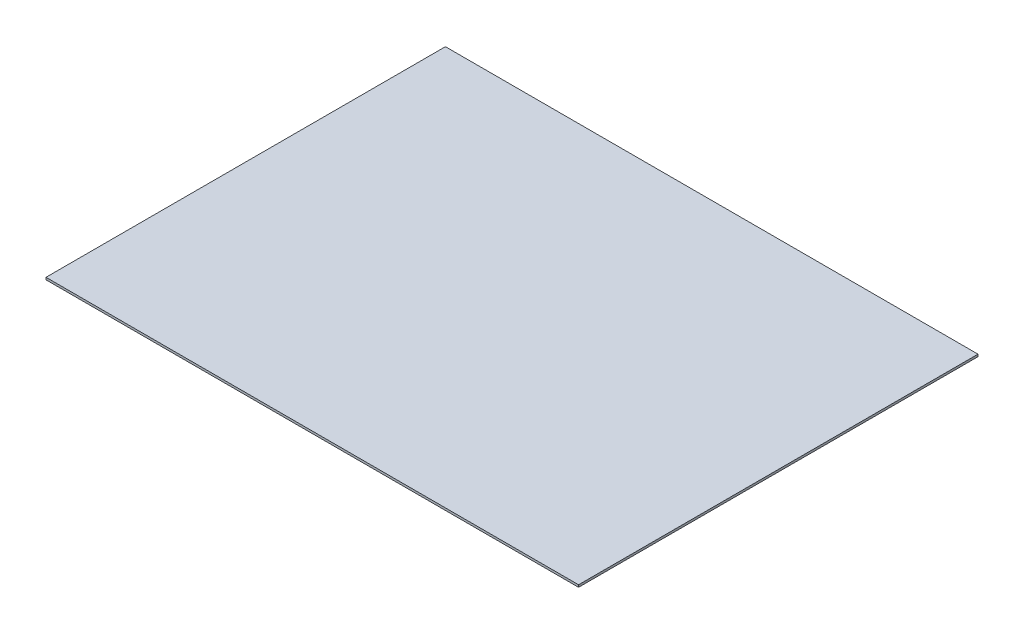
ISO-10303-21;
HEADER;
FILE_DESCRIPTION(('STEP AP214'),'2;1');
FILE_NAME('part.step','',(''),(''),'','','');
FILE_SCHEMA(('AUTOMOTIVE_DESIGN { 1 0 10303 214 1 1 1 1 }'));
ENDSEC;
DATA;
#1=APPLICATION_CONTEXT('core data for automotive mechanical design processes');
#2=APPLICATION_PROTOCOL_DEFINITION('international standard','automotive_design',2000,#1);
#3=PRODUCT_CONTEXT('',#1,'mechanical');
#4=PRODUCT('Part','Part','',(#3));
#5=PRODUCT_RELATED_PRODUCT_CATEGORY('part','',(#4));
#6=PRODUCT_DEFINITION_FORMATION('','',#4);
#7=PRODUCT_DEFINITION_CONTEXT('part definition',#1,'design');
#8=PRODUCT_DEFINITION('design','',#6,#7);
#9=PRODUCT_DEFINITION_SHAPE('','',#8);
#10=(LENGTH_UNIT() NAMED_UNIT(*) SI_UNIT(.MILLI.,.METRE.));
#11=(NAMED_UNIT(*) PLANE_ANGLE_UNIT() SI_UNIT($,.RADIAN.));
#12=(NAMED_UNIT(*) SI_UNIT($,.STERADIAN.) SOLID_ANGLE_UNIT());
#13=UNCERTAINTY_MEASURE_WITH_UNIT(LENGTH_MEASURE(1.E-05),#10,'distance_accuracy_value','');
#14=(GEOMETRIC_REPRESENTATION_CONTEXT(3) GLOBAL_UNCERTAINTY_ASSIGNED_CONTEXT((#13)) GLOBAL_UNIT_ASSIGNED_CONTEXT((#10,
#11,#12)) REPRESENTATION_CONTEXT('',''));
#15=CARTESIAN_POINT('',(0.,0.,0.));
#16=DIRECTION('',(0.,0.,1.));
#17=DIRECTION('',(1.,0.,0.));
#18=AXIS2_PLACEMENT_3D('',#15,#16,#17);
#19=CARTESIAN_POINT('',(1200.,10.,-900.));
#20=DIRECTION('',(-1.,0.,0.));
#21=DIRECTION('',(0.,0.,1.));
#22=AXIS2_PLACEMENT_3D('',#19,#20,#21);
#23=PLANE('',#22);
#24=DIRECTION('',(0.,0.,-1.));
#25=VECTOR('',#24,1.);
#26=CARTESIAN_POINT('',(1200.,0.,-900.));
#27=LINE('',#26,#25);
#28=CARTESIAN_POINT('',(1200.,0.,900.));
#29=VERTEX_POINT('',#28);
#30=CARTESIAN_POINT('',(1200.,0.,-900.));
#31=VERTEX_POINT('',#30);
#32=EDGE_CURVE('E102',#29,#31,#27,.T.);
#33=ORIENTED_EDGE('',*,*,#32,.T.);
#34=DIRECTION('',(0.,-1.,0.));
#35=VECTOR('',#34,1.);
#36=CARTESIAN_POINT('',(1200.,10.,-900.));
#37=LINE('',#36,#35);
#38=CARTESIAN_POINT('',(1200.,10.,-900.));
#39=VERTEX_POINT('',#38);
#40=EDGE_CURVE('E11',#39,#31,#37,.T.);
#41=ORIENTED_EDGE('',*,*,#40,.F.);
#42=DIRECTION('',(0.,0.,-1.));
#43=VECTOR('',#42,1.);
#44=CARTESIAN_POINT('',(1200.,10.,-900.));
#45=LINE('',#44,#43);
#46=CARTESIAN_POINT('',(1200.,10.,900.));
#47=VERTEX_POINT('',#46);
#48=EDGE_CURVE('E90',#47,#39,#45,.T.);
#49=ORIENTED_EDGE('',*,*,#48,.F.);
#50=DIRECTION('',(0.,-1.,0.));
#51=VECTOR('',#50,1.);
#52=CARTESIAN_POINT('',(1200.,10.,900.));
#53=LINE('',#52,#51);
#54=EDGE_CURVE('E98',#47,#29,#53,.T.);
#55=ORIENTED_EDGE('',*,*,#54,.T.);
#56=EDGE_LOOP('',(#33,#41,#49,#55));
#57=FACE_BOUND('',#56,.T.);
#58=ADVANCED_FACE('F39',(#57),#23,.F.);
#59=CARTESIAN_POINT('',(-1200.,10.,-900.));
#60=DIRECTION('',(0.,0.,1.));
#61=DIRECTION('',(1.,0.,0.));
#62=AXIS2_PLACEMENT_3D('',#59,#60,#61);
#63=PLANE('',#62);
#64=DIRECTION('',(-1.,0.,0.));
#65=VECTOR('',#64,1.);
#66=CARTESIAN_POINT('',(-1200.,0.,-900.));
#67=LINE('',#66,#65);
#68=CARTESIAN_POINT('',(-1200.,0.,-900.));
#69=VERTEX_POINT('',#68);
#70=EDGE_CURVE('E94',#31,#69,#67,.T.);
#71=ORIENTED_EDGE('',*,*,#70,.T.);
#72=DIRECTION('',(0.,-1.,0.));
#73=VECTOR('',#72,1.);
#74=CARTESIAN_POINT('',(-1200.,10.,-900.));
#75=LINE('',#74,#73);
#76=CARTESIAN_POINT('',(-1200.,10.,-900.));
#77=VERTEX_POINT('',#76);
#78=EDGE_CURVE('E47',#77,#69,#75,.T.);
#79=ORIENTED_EDGE('',*,*,#78,.F.);
#80=DIRECTION('',(-1.,0.,0.));
#81=VECTOR('',#80,1.);
#82=CARTESIAN_POINT('',(-1200.,10.,-900.));
#83=LINE('',#82,#81);
#84=EDGE_CURVE('E85',#39,#77,#83,.T.);
#85=ORIENTED_EDGE('',*,*,#84,.F.);
#86=ORIENTED_EDGE('',*,*,#40,.T.);
#87=EDGE_LOOP('',(#71,#79,#85,#86));
#88=FACE_BOUND('',#87,.T.);
#89=ADVANCED_FACE('F93',(#88),#63,.F.);
#90=CARTESIAN_POINT('',(-1200.,10.,-900.));
#91=DIRECTION('',(1.,0.,0.));
#92=DIRECTION('',(0.,0.,-1.));
#93=AXIS2_PLACEMENT_3D('',#90,#91,#92);
#94=PLANE('',#93);
#95=DIRECTION('',(0.,0.,1.));
#96=VECTOR('',#95,1.);
#97=CARTESIAN_POINT('',(-1200.,0.,-900.));
#98=LINE('',#97,#96);
#99=CARTESIAN_POINT('',(-1200.,0.,900.));
#100=VERTEX_POINT('',#99);
#101=EDGE_CURVE('E72',#69,#100,#98,.T.);
#102=ORIENTED_EDGE('',*,*,#101,.T.);
#103=DIRECTION('',(0.,-1.,0.));
#104=VECTOR('',#103,1.);
#105=CARTESIAN_POINT('',(-1200.,10.,900.));
#106=LINE('',#105,#104);
#107=CARTESIAN_POINT('',(-1200.,10.,900.));
#108=VERTEX_POINT('',#107);
#109=EDGE_CURVE('E95',#108,#100,#106,.T.);
#110=ORIENTED_EDGE('',*,*,#109,.F.);
#111=DIRECTION('',(0.,0.,1.));
#112=VECTOR('',#111,1.);
#113=CARTESIAN_POINT('',(-1200.,10.,-900.));
#114=LINE('',#113,#112);
#115=EDGE_CURVE('E88',#77,#108,#114,.T.);
#116=ORIENTED_EDGE('',*,*,#115,.F.);
#117=ORIENTED_EDGE('',*,*,#78,.T.);
#118=EDGE_LOOP('',(#102,#110,#116,#117));
#119=FACE_BOUND('',#118,.T.);
#120=ADVANCED_FACE('F96',(#119),#94,.F.);
#121=CARTESIAN_POINT('',(-1200.,10.,900.));
#122=DIRECTION('',(0.,0.,-1.));
#123=DIRECTION('',(-1.,0.,0.));
#124=AXIS2_PLACEMENT_3D('',#121,#122,#123);
#125=PLANE('',#124);
#126=DIRECTION('',(1.,0.,0.));
#127=VECTOR('',#126,1.);
#128=CARTESIAN_POINT('',(-1200.,0.,900.));
#129=LINE('',#128,#127);
#130=EDGE_CURVE('E78',#100,#29,#129,.T.);
#131=ORIENTED_EDGE('',*,*,#130,.T.);
#132=ORIENTED_EDGE('',*,*,#54,.F.);
#133=DIRECTION('',(1.,0.,0.));
#134=VECTOR('',#133,1.);
#135=CARTESIAN_POINT('',(-1200.,10.,900.));
#136=LINE('',#135,#134);
#137=EDGE_CURVE('E55',#108,#47,#136,.T.);
#138=ORIENTED_EDGE('',*,*,#137,.F.);
#139=ORIENTED_EDGE('',*,*,#109,.T.);
#140=EDGE_LOOP('',(#131,#132,#138,#139));
#141=FACE_BOUND('',#140,.T.);
#142=ADVANCED_FACE('F109',(#141),#125,.F.);
#143=CARTESIAN_POINT('',(0.,10.,0.));
#144=DIRECTION('',(0.,1.,0.));
#145=DIRECTION('',(0.,0.,1.));
#146=AXIS2_PLACEMENT_3D('',#143,#144,#145);
#147=PLANE('',#146);
#148=ORIENTED_EDGE('',*,*,#48,.T.);
#149=ORIENTED_EDGE('',*,*,#84,.T.);
#150=ORIENTED_EDGE('',*,*,#115,.T.);
#151=ORIENTED_EDGE('',*,*,#137,.T.);
#152=EDGE_LOOP('',(#148,#149,#150,#151));
#153=FACE_BOUND('',#152,.T.);
#154=ADVANCED_FACE('F86',(#153),#147,.T.);
#155=CARTESIAN_POINT('',(0.,0.,0.));
#156=DIRECTION('',(0.,1.,0.));
#157=DIRECTION('',(0.,0.,1.));
#158=AXIS2_PLACEMENT_3D('',#155,#156,#157);
#159=PLANE('',#158);
#160=ORIENTED_EDGE('',*,*,#32,.F.);
#161=ORIENTED_EDGE('',*,*,#130,.F.);
#162=ORIENTED_EDGE('',*,*,#101,.F.);
#163=ORIENTED_EDGE('',*,*,#70,.F.);
#164=EDGE_LOOP('',(#160,#161,#162,#163));
#165=FACE_BOUND('',#164,.T.);
#166=ADVANCED_FACE('F112',(#165),#159,.F.);
#167=CLOSED_SHELL('',(#58,#89,#120,#142,#154,#166));
#168=MANIFOLD_SOLID_BREP('B2',#167);
#169=ADVANCED_BREP_SHAPE_REPRESENTATION('',(#18,#168),#14);
#170=SHAPE_DEFINITION_REPRESENTATION(#9,#169);
ENDSEC;
END-ISO-10303-21;
